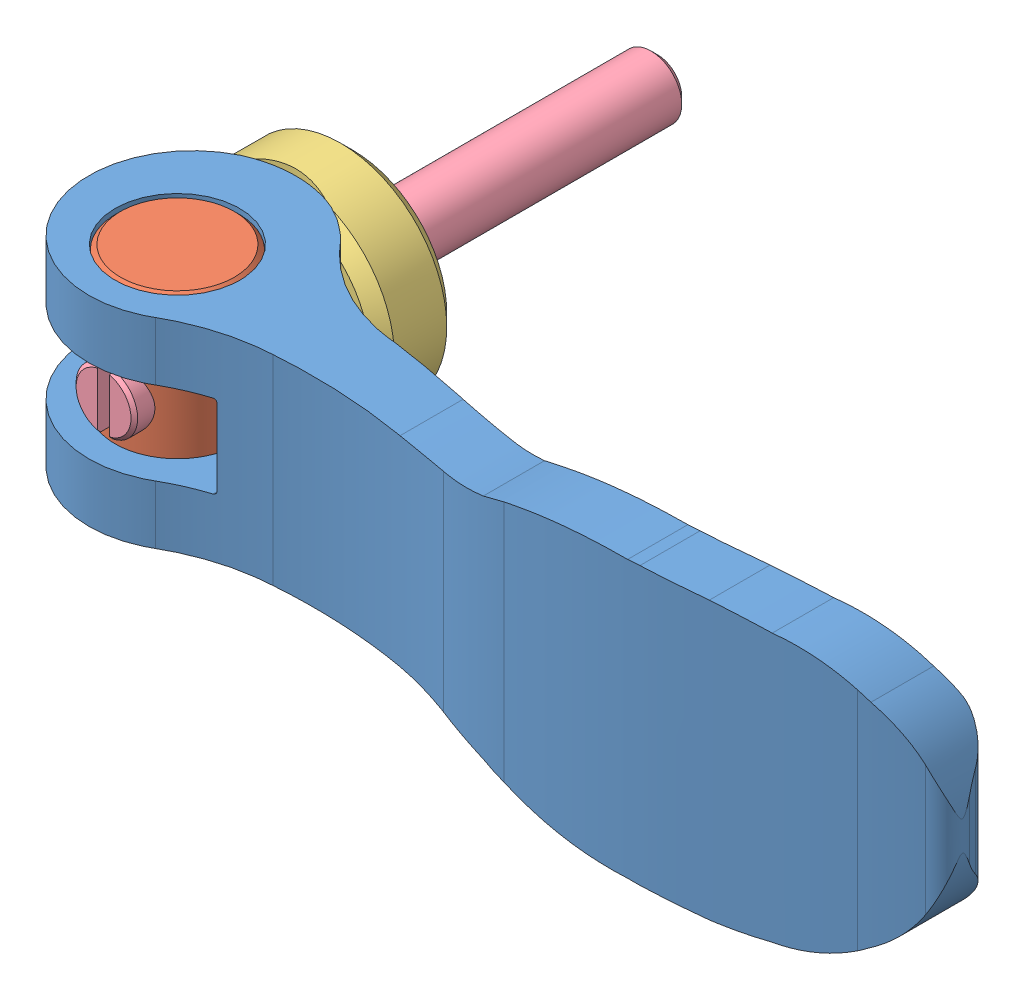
SolidWorks assembly KCL04X20-RE.SLDASM, configuration Default (file format 15000). Lengths in mm.
Overall size (59.2 18.05 37.01).
4 component instances, 4 part files, 0 mates.
Components (placement in the parent):
- KCL4X20-RE_01-1: KCL4X20-RE_01.SLDPRT [ﾃﾞﾌｫﾙﾄ] at (0 0 11.4) x (1 0 0) z (0 -1 0) size (59.1 13.57 18.05)
- KCL4X20-RE_02-1: KCL4X20-RE_02.SLDPRT [ﾃﾞﾌｫﾙﾄ] at (0 0 11.4) x (0 1 0) z (1 0 0) size (13 8 8)
- KCL4X20-RE_03-1: KCL4X20-RE_03.SLDPRT [ﾃﾞﾌｫﾙﾄ] x (1 0 0) z (0 -1 0) size (13.8 5.38 13.8)
- KCL4X20-RE_04-1: KCL4X20-RE_04.SLDPRT [ﾃﾞﾌｫﾙﾄ] at (0 0 -14.8) x (0 1 0) z (1 0 0) size (4 36 4)
